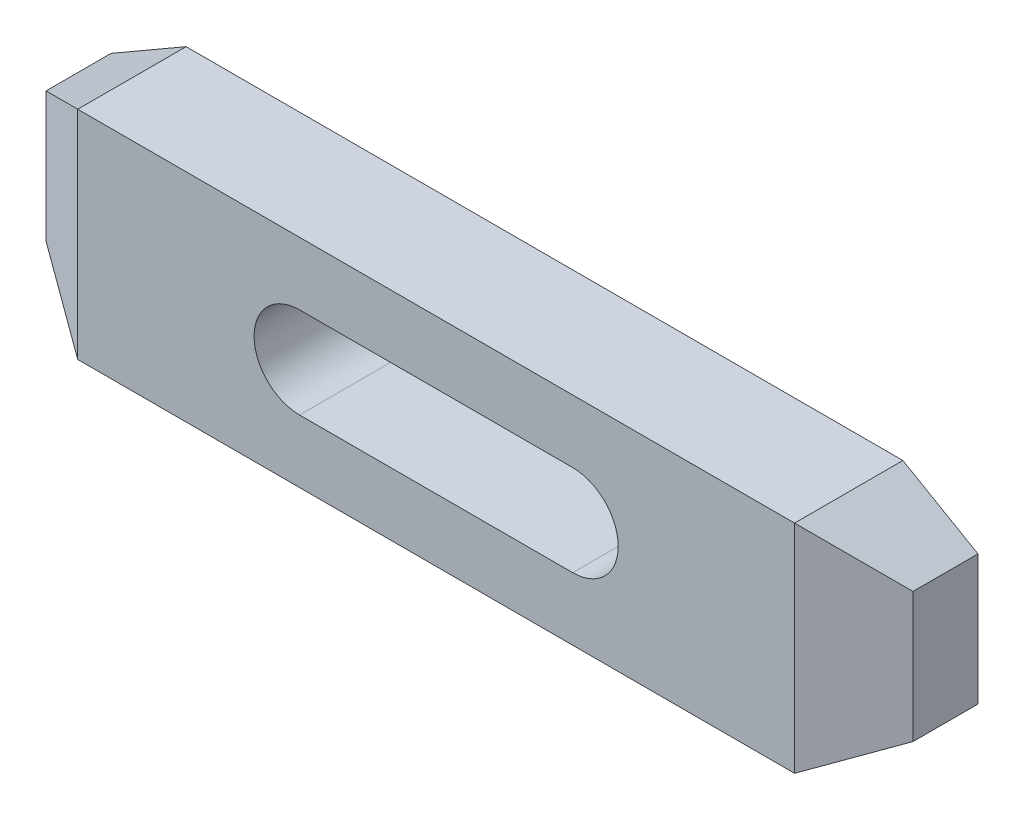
ISO-10303-21;
HEADER;
FILE_DESCRIPTION(('STEP AP214'),'2;1');
FILE_NAME('part.step','',(''),(''),'','','');
FILE_SCHEMA(('AUTOMOTIVE_DESIGN { 1 0 10303 214 1 1 1 1 }'));
ENDSEC;
DATA;
#1=APPLICATION_CONTEXT('core data for automotive mechanical design processes');
#2=APPLICATION_PROTOCOL_DEFINITION('international standard','automotive_design',2000,#1);
#3=PRODUCT_CONTEXT('',#1,'mechanical');
#4=PRODUCT('Part','Part','',(#3));
#5=PRODUCT_RELATED_PRODUCT_CATEGORY('part','',(#4));
#6=PRODUCT_DEFINITION_FORMATION('','',#4);
#7=PRODUCT_DEFINITION_CONTEXT('part definition',#1,'design');
#8=PRODUCT_DEFINITION('design','',#6,#7);
#9=PRODUCT_DEFINITION_SHAPE('','',#8);
#10=(LENGTH_UNIT() NAMED_UNIT(*) SI_UNIT(.MILLI.,.METRE.));
#11=(NAMED_UNIT(*) PLANE_ANGLE_UNIT() SI_UNIT($,.RADIAN.));
#12=(NAMED_UNIT(*) SI_UNIT($,.STERADIAN.) SOLID_ANGLE_UNIT());
#13=UNCERTAINTY_MEASURE_WITH_UNIT(LENGTH_MEASURE(1.E-05),#10,'distance_accuracy_value','');
#14=(GEOMETRIC_REPRESENTATION_CONTEXT(3) GLOBAL_UNCERTAINTY_ASSIGNED_CONTEXT((#13)) GLOBAL_UNIT_ASSIGNED_CONTEXT((#10,
#11,#12)) REPRESENTATION_CONTEXT('',''));
#15=CARTESIAN_POINT('',(0.,0.,0.));
#16=DIRECTION('',(0.,0.,1.));
#17=DIRECTION('',(1.,0.,0.));
#18=AXIS2_PLACEMENT_3D('',#15,#16,#17);
#19=CARTESIAN_POINT('',(0.,-72.7350269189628,25.));
#20=DIRECTION('',(0.,0.,-1.));
#21=DIRECTION('',(-1.,0.,0.));
#22=AXIS2_PLACEMENT_3D('',#19,#20,#21);
#23=PLANE('',#22);
#24=CARTESIAN_POINT('',(31.5,0.,25.));
#25=DIRECTION('',(0.,0.,1.));
#26=DIRECTION('',(1.,0.,0.));
#27=AXIS2_PLACEMENT_3D('',#24,#25,#26);
#28=CIRCLE('',#27,10.5);
#29=CARTESIAN_POINT('',(31.5,-10.5,25.));
#30=VERTEX_POINT('',#29);
#31=CARTESIAN_POINT('',(31.5,10.5,25.));
#32=VERTEX_POINT('',#31);
#33=EDGE_CURVE('E211',#30,#32,#28,.T.);
#34=ORIENTED_EDGE('',*,*,#33,.F.);
#35=DIRECTION('',(-1.,0.,0.));
#36=VECTOR('',#35,1.);
#37=CARTESIAN_POINT('',(31.5,-10.5,25.));
#38=LINE('',#37,#36);
#39=CARTESIAN_POINT('',(-31.5,-10.5,25.));
#40=VERTEX_POINT('',#39);
#41=EDGE_CURVE('E217',#30,#40,#38,.T.);
#42=ORIENTED_EDGE('',*,*,#41,.T.);
#43=CARTESIAN_POINT('',(-31.5,0.,25.));
#44=DIRECTION('',(0.,0.,1.));
#45=DIRECTION('',(1.,0.,0.));
#46=AXIS2_PLACEMENT_3D('',#43,#44,#45);
#47=CIRCLE('',#46,10.5);
#48=CARTESIAN_POINT('',(-31.5,10.5,25.));
#49=VERTEX_POINT('',#48);
#50=EDGE_CURVE('E221',#49,#40,#47,.T.);
#51=ORIENTED_EDGE('',*,*,#50,.F.);
#52=DIRECTION('',(-1.,0.,0.));
#53=VECTOR('',#52,1.);
#54=CARTESIAN_POINT('',(31.5,10.5,25.));
#55=LINE('',#54,#53);
#56=EDGE_CURVE('E223',#32,#49,#55,.T.);
#57=ORIENTED_EDGE('',*,*,#56,.F.);
#58=EDGE_LOOP('',(#34,#42,#51,#57));
#59=FACE_BOUND('',#58,.T.);
#60=DIRECTION('',(0.,1.,0.));
#61=VECTOR('',#60,1.);
#62=CARTESIAN_POINT('',(-82.679491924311,-72.7350269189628,25.));
#63=LINE('',#62,#61);
#64=CARTESIAN_POINT('',(-82.6794919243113,-25.,25.));
#65=VERTEX_POINT('',#64);
#66=CARTESIAN_POINT('',(-82.679491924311,25.,25.));
#67=VERTEX_POINT('',#66);
#68=EDGE_CURVE('E101',#65,#67,#63,.T.);
#69=ORIENTED_EDGE('',*,*,#68,.F.);
#70=DIRECTION('',(-1.,0.,0.));
#71=VECTOR('',#70,1.);
#72=CARTESIAN_POINT('',(82.6794919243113,-25.,25.));
#73=LINE('',#72,#71);
#74=CARTESIAN_POINT('',(82.6794919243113,-25.,25.));
#75=VERTEX_POINT('',#74);
#76=EDGE_CURVE('E111',#75,#65,#73,.T.);
#77=ORIENTED_EDGE('',*,*,#76,.F.);
#78=DIRECTION('',(0.,1.,0.));
#79=VECTOR('',#78,1.);
#80=CARTESIAN_POINT('',(82.6794919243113,-72.7350269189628,25.));
#81=LINE('',#80,#79);
#82=CARTESIAN_POINT('',(82.679491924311,25.,25.));
#83=VERTEX_POINT('',#82);
#84=EDGE_CURVE('E149',#75,#83,#81,.T.);
#85=ORIENTED_EDGE('',*,*,#84,.T.);
#86=DIRECTION('',(1.,0.,0.));
#87=VECTOR('',#86,1.);
#88=CARTESIAN_POINT('',(-82.679491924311,25.,25.));
#89=LINE('',#88,#87);
#90=EDGE_CURVE('E113',#67,#83,#89,.T.);
#91=ORIENTED_EDGE('',*,*,#90,.F.);
#92=EDGE_LOOP('',(#69,#77,#85,#91));
#93=FACE_BOUND('',#92,.T.);
#94=ADVANCED_FACE('F14',(#59,#93),#23,.F.);
#95=CARTESIAN_POINT('',(-100.,15.,25.));
#96=DIRECTION('',(-0.5,0.866025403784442,0.));
#97=DIRECTION('',(-0.866025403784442,-0.5,0.));
#98=AXIS2_PLACEMENT_3D('',#95,#96,#97);
#99=PLANE('',#98);
#100=DIRECTION('',(0.,0.,-1.));
#101=VECTOR('',#100,1.);
#102=CARTESIAN_POINT('',(-100.,15.,25.));
#103=LINE('',#102,#101);
#104=CARTESIAN_POINT('',(-100.,15.,15.));
#105=VERTEX_POINT('',#104);
#106=CARTESIAN_POINT('',(-100.,15.,0.));
#107=VERTEX_POINT('',#106);
#108=EDGE_CURVE('E139',#105,#107,#103,.T.);
#109=ORIENTED_EDGE('',*,*,#108,.F.);
#110=DIRECTION('',(0.774596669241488,0.447213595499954,0.447213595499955));
#111=VECTOR('',#110,1.);
#112=CARTESIAN_POINT('',(-96.5358983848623,17.,17.));
#113=LINE('',#112,#111);
#114=EDGE_CURVE('E114',#105,#67,#113,.T.);
#115=ORIENTED_EDGE('',*,*,#114,.T.);
#116=DIRECTION('',(0.,0.,-1.));
#117=VECTOR('',#116,1.);
#118=CARTESIAN_POINT('',(-82.679491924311,25.,25.));
#119=LINE('',#118,#117);
#120=CARTESIAN_POINT('',(-82.679491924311,25.,0.));
#121=VERTEX_POINT('',#120);
#122=EDGE_CURVE('E141',#67,#121,#119,.T.);
#123=ORIENTED_EDGE('',*,*,#122,.T.);
#124=DIRECTION('',(0.866025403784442,0.5,0.));
#125=VECTOR('',#124,1.);
#126=CARTESIAN_POINT('',(-100.,15.,0.));
#127=LINE('',#126,#125);
#128=EDGE_CURVE('E170',#107,#121,#127,.T.);
#129=ORIENTED_EDGE('',*,*,#128,.F.);
#130=EDGE_LOOP('',(#109,#115,#123,#129));
#131=FACE_BOUND('',#130,.T.);
#132=ADVANCED_FACE('F169',(#131),#99,.T.);
#133=CARTESIAN_POINT('',(-100.,-15.,25.));
#134=DIRECTION('',(-1.,0.,0.));
#135=DIRECTION('',(0.,0.,1.));
#136=AXIS2_PLACEMENT_3D('',#133,#134,#135);
#137=PLANE('',#136);
#138=DIRECTION('',(0.,0.,-1.));
#139=VECTOR('',#138,1.);
#140=CARTESIAN_POINT('',(-100.,-15.,25.));
#141=LINE('',#140,#139);
#142=CARTESIAN_POINT('',(-100.,-15.,15.));
#143=VERTEX_POINT('',#142);
#144=CARTESIAN_POINT('',(-100.,-15.,0.));
#145=VERTEX_POINT('',#144);
#146=EDGE_CURVE('E124',#143,#145,#141,.T.);
#147=ORIENTED_EDGE('',*,*,#146,.F.);
#148=DIRECTION('',(0.,1.,0.));
#149=VECTOR('',#148,1.);
#150=CARTESIAN_POINT('',(-100.,-25.,15.));
#151=LINE('',#150,#149);
#152=EDGE_CURVE('E29',#143,#105,#151,.T.);
#153=ORIENTED_EDGE('',*,*,#152,.T.);
#154=ORIENTED_EDGE('',*,*,#108,.T.);
#155=DIRECTION('',(0.,1.,0.));
#156=VECTOR('',#155,1.);
#157=CARTESIAN_POINT('',(-100.,-15.,0.));
#158=LINE('',#157,#156);
#159=EDGE_CURVE('E177',#145,#107,#158,.T.);
#160=ORIENTED_EDGE('',*,*,#159,.F.);
#161=EDGE_LOOP('',(#147,#153,#154,#160));
#162=FACE_BOUND('',#161,.T.);
#163=ADVANCED_FACE('F259',(#162),#137,.T.);
#164=CARTESIAN_POINT('',(-82.6794919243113,-25.,25.));
#165=DIRECTION('',(-0.5,-0.866025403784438,0.));
#166=DIRECTION('',(0.866025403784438,-0.5,0.));
#167=AXIS2_PLACEMENT_3D('',#164,#165,#166);
#168=PLANE('',#167);
#169=DIRECTION('',(0.,0.,-1.));
#170=VECTOR('',#169,1.);
#171=CARTESIAN_POINT('',(-82.6794919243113,-25.,25.));
#172=LINE('',#171,#170);
#173=CARTESIAN_POINT('',(-82.6794919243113,-25.,0.));
#174=VERTEX_POINT('',#173);
#175=EDGE_CURVE('E117',#65,#174,#172,.T.);
#176=ORIENTED_EDGE('',*,*,#175,.F.);
#177=DIRECTION('',(-0.774596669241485,0.44721359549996,-0.447213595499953));
#178=VECTOR('',#177,1.);
#179=CARTESIAN_POINT('',(-82.6794919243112,-25.,25.));
#180=LINE('',#179,#178);
#181=EDGE_CURVE('E9',#65,#143,#180,.T.);
#182=ORIENTED_EDGE('',*,*,#181,.T.);
#183=ORIENTED_EDGE('',*,*,#146,.T.);
#184=DIRECTION('',(-0.866025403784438,0.5,0.));
#185=VECTOR('',#184,1.);
#186=CARTESIAN_POINT('',(-82.6794919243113,-25.,0.));
#187=LINE('',#186,#185);
#188=EDGE_CURVE('E120',#174,#145,#187,.T.);
#189=ORIENTED_EDGE('',*,*,#188,.F.);
#190=EDGE_LOOP('',(#176,#182,#183,#189));
#191=FACE_BOUND('',#190,.T.);
#192=ADVANCED_FACE('F118',(#191),#168,.T.);
#193=CARTESIAN_POINT('',(0.,-72.7350269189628,0.));
#194=DIRECTION('',(0.,0.,-1.));
#195=DIRECTION('',(-1.,0.,0.));
#196=AXIS2_PLACEMENT_3D('',#193,#194,#195);
#197=PLANE('',#196);
#198=DIRECTION('',(-0.866025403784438,-0.5,0.));
#199=VECTOR('',#198,1.);
#200=CARTESIAN_POINT('',(100.,-15.,0.));
#201=LINE('',#200,#199);
#202=CARTESIAN_POINT('',(100.,-15.,0.));
#203=VERTEX_POINT('',#202);
#204=CARTESIAN_POINT('',(82.6794919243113,-25.,0.));
#205=VERTEX_POINT('',#204);
#206=EDGE_CURVE('E185',#203,#205,#201,.T.);
#207=ORIENTED_EDGE('',*,*,#206,.T.);
#208=DIRECTION('',(-1.,0.,0.));
#209=VECTOR('',#208,1.);
#210=CARTESIAN_POINT('',(82.6794919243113,-25.,0.));
#211=LINE('',#210,#209);
#212=EDGE_CURVE('E184',#205,#174,#211,.T.);
#213=ORIENTED_EDGE('',*,*,#212,.T.);
#214=ORIENTED_EDGE('',*,*,#188,.T.);
#215=ORIENTED_EDGE('',*,*,#159,.T.);
#216=ORIENTED_EDGE('',*,*,#128,.T.);
#217=DIRECTION('',(1.,0.,0.));
#218=VECTOR('',#217,1.);
#219=CARTESIAN_POINT('',(-82.679491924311,25.,0.));
#220=LINE('',#219,#218);
#221=CARTESIAN_POINT('',(82.679491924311,25.,0.));
#222=VERTEX_POINT('',#221);
#223=EDGE_CURVE('E164',#121,#222,#220,.T.);
#224=ORIENTED_EDGE('',*,*,#223,.T.);
#225=DIRECTION('',(0.866025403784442,-0.5,0.));
#226=VECTOR('',#225,1.);
#227=CARTESIAN_POINT('',(82.679491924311,25.,0.));
#228=LINE('',#227,#226);
#229=CARTESIAN_POINT('',(100.,15.,0.));
#230=VERTEX_POINT('',#229);
#231=EDGE_CURVE('E133',#222,#230,#228,.T.);
#232=ORIENTED_EDGE('',*,*,#231,.T.);
#233=DIRECTION('',(0.,-1.,0.));
#234=VECTOR('',#233,1.);
#235=CARTESIAN_POINT('',(100.,15.,0.));
#236=LINE('',#235,#234);
#237=EDGE_CURVE('E129',#230,#203,#236,.T.);
#238=ORIENTED_EDGE('',*,*,#237,.T.);
#239=EDGE_LOOP('',(#207,#213,#214,#215,#216,#224,#232,#238));
#240=FACE_BOUND('',#239,.T.);
#241=DIRECTION('',(-1.,0.,0.));
#242=VECTOR('',#241,1.);
#243=CARTESIAN_POINT('',(31.5,-10.5,0.));
#244=LINE('',#243,#242);
#245=CARTESIAN_POINT('',(31.5,-10.5,0.));
#246=VERTEX_POINT('',#245);
#247=CARTESIAN_POINT('',(-31.5,-10.5,0.));
#248=VERTEX_POINT('',#247);
#249=EDGE_CURVE('E208',#246,#248,#244,.T.);
#250=ORIENTED_EDGE('',*,*,#249,.F.);
#251=CARTESIAN_POINT('',(31.5,0.,0.));
#252=DIRECTION('',(0.,0.,1.));
#253=DIRECTION('',(1.,0.,0.));
#254=AXIS2_PLACEMENT_3D('',#251,#252,#253);
#255=CIRCLE('',#254,10.5);
#256=CARTESIAN_POINT('',(31.5,10.5,0.));
#257=VERTEX_POINT('',#256);
#258=EDGE_CURVE('E201',#246,#257,#255,.T.);
#259=ORIENTED_EDGE('',*,*,#258,.T.);
#260=DIRECTION('',(-1.,0.,0.));
#261=VECTOR('',#260,1.);
#262=CARTESIAN_POINT('',(31.5,10.5,0.));
#263=LINE('',#262,#261);
#264=CARTESIAN_POINT('',(-31.5,10.5,0.));
#265=VERTEX_POINT('',#264);
#266=EDGE_CURVE('E204',#257,#265,#263,.T.);
#267=ORIENTED_EDGE('',*,*,#266,.T.);
#268=CARTESIAN_POINT('',(-31.5,0.,0.));
#269=DIRECTION('',(0.,0.,1.));
#270=DIRECTION('',(1.,0.,0.));
#271=AXIS2_PLACEMENT_3D('',#268,#269,#270);
#272=CIRCLE('',#271,10.5);
#273=EDGE_CURVE('E212',#265,#248,#272,.T.);
#274=ORIENTED_EDGE('',*,*,#273,.T.);
#275=EDGE_LOOP('',(#250,#259,#267,#274));
#276=FACE_BOUND('',#275,.T.);
#277=ADVANCED_FACE('F174',(#240,#276),#197,.T.);
#278=CARTESIAN_POINT('',(100.,-15.,25.));
#279=DIRECTION('',(0.5,-0.866025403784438,0.));
#280=DIRECTION('',(0.866025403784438,0.5,0.));
#281=AXIS2_PLACEMENT_3D('',#278,#279,#280);
#282=PLANE('',#281);
#283=DIRECTION('',(0.774596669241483,0.447213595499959,-0.447213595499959));
#284=VECTOR('',#283,1.);
#285=CARTESIAN_POINT('',(96.5358983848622,-17.,17.));
#286=LINE('',#285,#284);
#287=CARTESIAN_POINT('',(100.,-15.,15.));
#288=VERTEX_POINT('',#287);
#289=EDGE_CURVE('E154',#75,#288,#286,.T.);
#290=ORIENTED_EDGE('',*,*,#289,.F.);
#291=DIRECTION('',(0.,0.,-1.));
#292=VECTOR('',#291,1.);
#293=CARTESIAN_POINT('',(82.6794919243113,-25.,25.));
#294=LINE('',#293,#292);
#295=EDGE_CURVE('E125',#75,#205,#294,.T.);
#296=ORIENTED_EDGE('',*,*,#295,.T.);
#297=ORIENTED_EDGE('',*,*,#206,.F.);
#298=DIRECTION('',(0.,0.,-1.));
#299=VECTOR('',#298,1.);
#300=CARTESIAN_POINT('',(100.,-15.,25.));
#301=LINE('',#300,#299);
#302=EDGE_CURVE('E147',#288,#203,#301,.T.);
#303=ORIENTED_EDGE('',*,*,#302,.F.);
#304=EDGE_LOOP('',(#290,#296,#297,#303));
#305=FACE_BOUND('',#304,.T.);
#306=ADVANCED_FACE('F200',(#305),#282,.T.);
#307=CARTESIAN_POINT('',(100.,15.,25.));
#308=DIRECTION('',(1.,0.,0.));
#309=DIRECTION('',(0.,0.,-1.));
#310=AXIS2_PLACEMENT_3D('',#307,#308,#309);
#311=PLANE('',#310);
#312=DIRECTION('',(0.,1.,0.));
#313=VECTOR('',#312,1.);
#314=CARTESIAN_POINT('',(100.,-25.,15.));
#315=LINE('',#314,#313);
#316=CARTESIAN_POINT('',(100.,15.,15.));
#317=VERTEX_POINT('',#316);
#318=EDGE_CURVE('E36',#288,#317,#315,.T.);
#319=ORIENTED_EDGE('',*,*,#318,.F.);
#320=ORIENTED_EDGE('',*,*,#302,.T.);
#321=ORIENTED_EDGE('',*,*,#237,.F.);
#322=DIRECTION('',(0.,0.,-1.));
#323=VECTOR('',#322,1.);
#324=CARTESIAN_POINT('',(100.,15.,25.));
#325=LINE('',#324,#323);
#326=EDGE_CURVE('E145',#317,#230,#325,.T.);
#327=ORIENTED_EDGE('',*,*,#326,.F.);
#328=EDGE_LOOP('',(#319,#320,#321,#327));
#329=FACE_BOUND('',#328,.T.);
#330=ADVANCED_FACE('F16',(#329),#311,.T.);
#331=CARTESIAN_POINT('',(82.679491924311,25.,25.));
#332=DIRECTION('',(0.5,0.866025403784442,0.));
#333=DIRECTION('',(-0.866025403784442,0.5,0.));
#334=AXIS2_PLACEMENT_3D('',#331,#332,#333);
#335=PLANE('',#334);
#336=DIRECTION('',(-0.774596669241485,0.447213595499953,0.44721359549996));
#337=VECTOR('',#336,1.);
#338=CARTESIAN_POINT('',(82.679491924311,25.,25.));
#339=LINE('',#338,#337);
#340=EDGE_CURVE('E22',#317,#83,#339,.T.);
#341=ORIENTED_EDGE('',*,*,#340,.F.);
#342=ORIENTED_EDGE('',*,*,#326,.T.);
#343=ORIENTED_EDGE('',*,*,#231,.F.);
#344=DIRECTION('',(0.,0.,-1.));
#345=VECTOR('',#344,1.);
#346=CARTESIAN_POINT('',(82.679491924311,25.,25.));
#347=LINE('',#346,#345);
#348=EDGE_CURVE('E143',#83,#222,#347,.T.);
#349=ORIENTED_EDGE('',*,*,#348,.F.);
#350=EDGE_LOOP('',(#341,#342,#343,#349));
#351=FACE_BOUND('',#350,.T.);
#352=ADVANCED_FACE('F157',(#351),#335,.T.);
#353=CARTESIAN_POINT('',(-82.679491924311,25.,25.));
#354=DIRECTION('',(0.,1.,0.));
#355=DIRECTION('',(0.,0.,1.));
#356=AXIS2_PLACEMENT_3D('',#353,#354,#355);
#357=PLANE('',#356);
#358=ORIENTED_EDGE('',*,*,#122,.F.);
#359=ORIENTED_EDGE('',*,*,#90,.T.);
#360=ORIENTED_EDGE('',*,*,#348,.T.);
#361=ORIENTED_EDGE('',*,*,#223,.F.);
#362=EDGE_LOOP('',(#358,#359,#360,#361));
#363=FACE_BOUND('',#362,.T.);
#364=ADVANCED_FACE('F163',(#363),#357,.T.);
#365=CARTESIAN_POINT('',(82.6794919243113,-25.,25.));
#366=DIRECTION('',(0.,-1.,0.));
#367=DIRECTION('',(1.,0.,0.));
#368=AXIS2_PLACEMENT_3D('',#365,#366,#367);
#369=PLANE('',#368);
#370=ORIENTED_EDGE('',*,*,#76,.T.);
#371=ORIENTED_EDGE('',*,*,#175,.T.);
#372=ORIENTED_EDGE('',*,*,#212,.F.);
#373=ORIENTED_EDGE('',*,*,#295,.F.);
#374=EDGE_LOOP('',(#370,#371,#372,#373));
#375=FACE_BOUND('',#374,.T.);
#376=ADVANCED_FACE('F128',(#375),#369,.T.);
#377=CARTESIAN_POINT('',(31.5,0.,25.));
#378=DIRECTION('',(0.,0.,-1.));
#379=DIRECTION('',(-1.,0.,0.));
#380=AXIS2_PLACEMENT_3D('',#377,#378,#379);
#381=CYLINDRICAL_SURFACE('',#380,10.5);
#382=DIRECTION('',(0.,0.,-1.));
#383=VECTOR('',#382,1.);
#384=CARTESIAN_POINT('',(31.5,10.5,25.));
#385=LINE('',#384,#383);
#386=EDGE_CURVE('E186',#32,#257,#385,.T.);
#387=ORIENTED_EDGE('',*,*,#386,.T.);
#388=ORIENTED_EDGE('',*,*,#258,.F.);
#389=DIRECTION('',(0.,0.,-1.));
#390=VECTOR('',#389,1.);
#391=CARTESIAN_POINT('',(31.5,-10.5,25.));
#392=LINE('',#391,#390);
#393=EDGE_CURVE('E220',#30,#246,#392,.T.);
#394=ORIENTED_EDGE('',*,*,#393,.F.);
#395=ORIENTED_EDGE('',*,*,#33,.T.);
#396=EDGE_LOOP('',(#387,#388,#394,#395));
#397=FACE_BOUND('',#396,.T.);
#398=ADVANCED_FACE('F242',(#397),#381,.F.);
#399=CARTESIAN_POINT('',(31.5,10.5,25.));
#400=DIRECTION('',(0.,-1.,0.));
#401=DIRECTION('',(1.,0.,0.));
#402=AXIS2_PLACEMENT_3D('',#399,#400,#401);
#403=PLANE('',#402);
#404=DIRECTION('',(0.,0.,-1.));
#405=VECTOR('',#404,1.);
#406=CARTESIAN_POINT('',(-31.5,10.5,25.));
#407=LINE('',#406,#405);
#408=EDGE_CURVE('E188',#49,#265,#407,.T.);
#409=ORIENTED_EDGE('',*,*,#408,.T.);
#410=ORIENTED_EDGE('',*,*,#266,.F.);
#411=ORIENTED_EDGE('',*,*,#386,.F.);
#412=ORIENTED_EDGE('',*,*,#56,.T.);
#413=EDGE_LOOP('',(#409,#410,#411,#412));
#414=FACE_BOUND('',#413,.T.);
#415=ADVANCED_FACE('F238',(#414),#403,.T.);
#416=CARTESIAN_POINT('',(-31.5,0.,25.));
#417=DIRECTION('',(0.,0.,-1.));
#418=DIRECTION('',(-1.,0.,0.));
#419=AXIS2_PLACEMENT_3D('',#416,#417,#418);
#420=CYLINDRICAL_SURFACE('',#419,10.5);
#421=DIRECTION('',(0.,0.,-1.));
#422=VECTOR('',#421,1.);
#423=CARTESIAN_POINT('',(-31.5,-10.5,25.));
#424=LINE('',#423,#422);
#425=EDGE_CURVE('E193',#40,#248,#424,.T.);
#426=ORIENTED_EDGE('',*,*,#425,.T.);
#427=ORIENTED_EDGE('',*,*,#273,.F.);
#428=ORIENTED_EDGE('',*,*,#408,.F.);
#429=ORIENTED_EDGE('',*,*,#50,.T.);
#430=EDGE_LOOP('',(#426,#427,#428,#429));
#431=FACE_BOUND('',#430,.T.);
#432=ADVANCED_FACE('F231',(#431),#420,.F.);
#433=CARTESIAN_POINT('',(31.5,-10.5,25.));
#434=DIRECTION('',(0.,-1.,0.));
#435=DIRECTION('',(1.,0.,0.));
#436=AXIS2_PLACEMENT_3D('',#433,#434,#435);
#437=PLANE('',#436);
#438=ORIENTED_EDGE('',*,*,#41,.F.);
#439=ORIENTED_EDGE('',*,*,#393,.T.);
#440=ORIENTED_EDGE('',*,*,#249,.T.);
#441=ORIENTED_EDGE('',*,*,#425,.F.);
#442=EDGE_LOOP('',(#438,#439,#440,#441));
#443=FACE_BOUND('',#442,.T.);
#444=ADVANCED_FACE('F236',(#443),#437,.F.);
#445=CARTESIAN_POINT('',(100.,-25.,15.));
#446=DIRECTION('',(-0.5,0.,-0.866025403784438));
#447=DIRECTION('',(-0.866025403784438,0.,0.5));
#448=AXIS2_PLACEMENT_3D('',#445,#446,#447);
#449=PLANE('',#448);
#450=ORIENTED_EDGE('',*,*,#289,.T.);
#451=ORIENTED_EDGE('',*,*,#318,.T.);
#452=ORIENTED_EDGE('',*,*,#340,.T.);
#453=ORIENTED_EDGE('',*,*,#84,.F.);
#454=EDGE_LOOP('',(#450,#451,#452,#453));
#455=FACE_BOUND('',#454,.T.);
#456=ADVANCED_FACE('F148',(#455),#449,.F.);
#457=CARTESIAN_POINT('',(-100.,-25.,15.));
#458=DIRECTION('',(-0.5,0.,0.866025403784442));
#459=DIRECTION('',(0.866025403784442,0.,0.5));
#460=AXIS2_PLACEMENT_3D('',#457,#458,#459);
#461=PLANE('',#460);
#462=ORIENTED_EDGE('',*,*,#152,.F.);
#463=ORIENTED_EDGE('',*,*,#181,.F.);
#464=ORIENTED_EDGE('',*,*,#68,.T.);
#465=ORIENTED_EDGE('',*,*,#114,.F.);
#466=EDGE_LOOP('',(#462,#463,#464,#465));
#467=FACE_BOUND('',#466,.T.);
#468=ADVANCED_FACE('F100',(#467),#461,.T.);
#469=CLOSED_SHELL('',(#94,#132,#163,#192,#277,#306,#330,#352,#364,#376,#398,#415,#432,#444,#456,#468));
#470=MANIFOLD_SOLID_BREP('B1',#469);
#471=ADVANCED_BREP_SHAPE_REPRESENTATION('',(#18,#470),#14);
#472=SHAPE_DEFINITION_REPRESENTATION(#9,#471);
ENDSEC;
END-ISO-10303-21;
